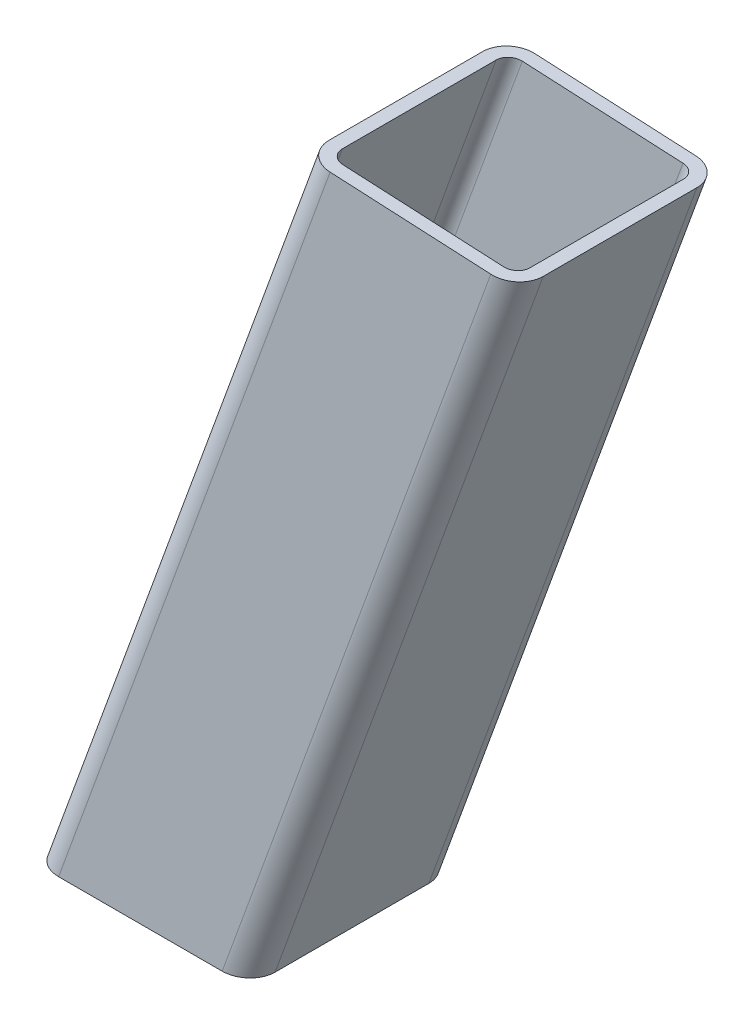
ISO-10303-21;
HEADER;
FILE_DESCRIPTION(('STEP AP214'),'2;1');
FILE_NAME('part.step','',(''),(''),'','','');
FILE_SCHEMA(('AUTOMOTIVE_DESIGN { 1 0 10303 214 1 1 1 1 }'));
ENDSEC;
DATA;
#1=APPLICATION_CONTEXT('core data for automotive mechanical design processes');
#2=APPLICATION_PROTOCOL_DEFINITION('international standard','automotive_design',2000,#1);
#3=PRODUCT_CONTEXT('',#1,'mechanical');
#4=PRODUCT('Part','Part','',(#3));
#5=PRODUCT_RELATED_PRODUCT_CATEGORY('part','',(#4));
#6=PRODUCT_DEFINITION_FORMATION('','',#4);
#7=PRODUCT_DEFINITION_CONTEXT('part definition',#1,'design');
#8=PRODUCT_DEFINITION('design','',#6,#7);
#9=PRODUCT_DEFINITION_SHAPE('','',#8);
#10=(LENGTH_UNIT() NAMED_UNIT(*) SI_UNIT(.MILLI.,.METRE.));
#11=(NAMED_UNIT(*) PLANE_ANGLE_UNIT() SI_UNIT($,.RADIAN.));
#12=(NAMED_UNIT(*) SI_UNIT($,.STERADIAN.) SOLID_ANGLE_UNIT());
#13=UNCERTAINTY_MEASURE_WITH_UNIT(LENGTH_MEASURE(1.E-05),#10,'distance_accuracy_value','');
#14=(GEOMETRIC_REPRESENTATION_CONTEXT(3) GLOBAL_UNCERTAINTY_ASSIGNED_CONTEXT((#13)) GLOBAL_UNIT_ASSIGNED_CONTEXT((#10,
#11,#12)) REPRESENTATION_CONTEXT('',''));
#15=CARTESIAN_POINT('',(0.,0.,0.));
#16=DIRECTION('',(0.,0.,1.));
#17=DIRECTION('',(1.,0.,0.));
#18=AXIS2_PLACEMENT_3D('',#15,#16,#17);
#19=CARTESIAN_POINT('',(356.44315661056,409.402345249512,30.));
#20=DIRECTION('',(0.939692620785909,-0.342020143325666,0.));
#21=DIRECTION('',(0.342020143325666,0.93969262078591,0.));
#22=AXIS2_PLACEMENT_3D('',#19,#20,#21);
#23=PLANE('',#22);
#24=DIRECTION('',(0.,0.,-1.));
#25=VECTOR('',#24,1.);
#26=CARTESIAN_POINT('',(228.179192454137,56.9999999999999,29.9999999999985));
#27=LINE('',#26,#25);
#28=CARTESIAN_POINT('',(228.179192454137,57.0000000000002,30.));
#29=VERTEX_POINT('',#28);
#30=CARTESIAN_POINT('',(228.179192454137,57.0000000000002,-30.));
#31=VERTEX_POINT('',#30);
#32=EDGE_CURVE('E184',#29,#31,#27,.T.);
#33=ORIENTED_EDGE('',*,*,#32,.F.);
#34=DIRECTION('',(-0.342020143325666,-0.939692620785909,0.));
#35=VECTOR('',#34,1.);
#36=CARTESIAN_POINT('',(356.44315661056,409.402345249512,30.));
#37=LINE('',#36,#35);
#38=CARTESIAN_POINT('',(334.330386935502,348.648009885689,30.));
#39=VERTEX_POINT('',#38);
#40=EDGE_CURVE('E217',#39,#29,#37,.T.);
#41=ORIENTED_EDGE('',*,*,#40,.F.);
#42=DIRECTION('',(0.,0.,1.));
#43=VECTOR('',#42,1.);
#44=CARTESIAN_POINT('',(334.330386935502,348.648009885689,30.));
#45=LINE('',#44,#43);
#46=CARTESIAN_POINT('',(334.330386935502,348.648009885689,-30.));
#47=VERTEX_POINT('',#46);
#48=EDGE_CURVE('E227',#47,#39,#45,.T.);
#49=ORIENTED_EDGE('',*,*,#48,.F.);
#50=DIRECTION('',(-0.342020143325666,-0.939692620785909,0.));
#51=VECTOR('',#50,1.);
#52=CARTESIAN_POINT('',(356.44315661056,409.402345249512,-30.));
#53=LINE('',#52,#51);
#54=EDGE_CURVE('E248',#47,#31,#53,.T.);
#55=ORIENTED_EDGE('',*,*,#54,.T.);
#56=EDGE_LOOP('',(#33,#41,#49,#55));
#57=FACE_BOUND('',#56,.T.);
#58=ADVANCED_FACE('F34',(#57),#23,.F.);
#59=CARTESIAN_POINT('',(365.840082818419,405.982143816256,-30.));
#60=DIRECTION('',(-0.342020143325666,-0.939692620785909,0.));
#61=DIRECTION('',(0.93969262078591,-0.342020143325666,0.));
#62=AXIS2_PLACEMENT_3D('',#59,#60,#61);
#63=CYLINDRICAL_SURFACE('',#62,10.);
#64=CARTESIAN_POINT('',(238.820970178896,57.0000000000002,-30.));
#65=DIRECTION('',(0.,-1.,0.));
#66=DIRECTION('',(-1.,0.,0.));
#67=AXIS2_PLACEMENT_3D('',#64,#65,#66);
#68=ELLIPSE('',#67,10.6417777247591,10.);
#69=CARTESIAN_POINT('',(238.820970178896,57.0000000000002,-40.));
#70=VERTEX_POINT('',#69);
#71=EDGE_CURVE('E183',#31,#70,#68,.T.);
#72=ORIENTED_EDGE('',*,*,#71,.F.);
#73=ORIENTED_EDGE('',*,*,#54,.F.);
#74=CARTESIAN_POINT('',(344.781706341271,348.124729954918,-30.));
#75=DIRECTION('',(0.0500056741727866,0.998748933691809,0.));
#76=DIRECTION('',(-0.998748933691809,0.0500056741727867,0.));
#77=AXIS2_PLACEMENT_3D('',#74,#75,#76);
#78=ELLIPSE('',#77,10.464411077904,10.);
#79=CARTESIAN_POINT('',(344.781706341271,348.124729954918,-40.));
#80=VERTEX_POINT('',#79);
#81=EDGE_CURVE('E122',#80,#47,#78,.T.);
#82=ORIENTED_EDGE('',*,*,#81,.F.);
#83=DIRECTION('',(-0.342020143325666,-0.939692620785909,0.));
#84=VECTOR('',#83,1.);
#85=CARTESIAN_POINT('',(365.840082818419,405.982143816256,-40.));
#86=LINE('',#85,#84);
#87=EDGE_CURVE('E245',#80,#70,#86,.T.);
#88=ORIENTED_EDGE('',*,*,#87,.T.);
#89=EDGE_LOOP('',(#72,#73,#82,#88));
#90=FACE_BOUND('',#89,.T.);
#91=ADVANCED_FACE('F308',(#90),#63,.T.);
#92=CARTESIAN_POINT('',(422.221640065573,385.460935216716,-40.));
#93=DIRECTION('',(0.,0.,1.));
#94=DIRECTION('',(1.,0.,0.));
#95=AXIS2_PLACEMENT_3D('',#92,#93,#94);
#96=PLANE('',#95);
#97=DIRECTION('',(1.,0.,0.));
#98=VECTOR('',#97,1.);
#99=CARTESIAN_POINT('',(422.221640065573,57.0000000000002,-40.));
#100=LINE('',#99,#98);
#101=CARTESIAN_POINT('',(302.671636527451,57.0000000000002,-40.));
#102=VERTEX_POINT('',#101);
#103=EDGE_CURVE('E181',#70,#102,#100,.T.);
#104=ORIENTED_EDGE('',*,*,#103,.F.);
#105=ORIENTED_EDGE('',*,*,#87,.F.);
#106=DIRECTION('',(-0.998748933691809,0.0500056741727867,0.));
#107=VECTOR('',#106,1.);
#108=CARTESIAN_POINT('',(420.163309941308,344.35050023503,-40.));
#109=LINE('',#108,#107);
#110=CARTESIAN_POINT('',(407.489622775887,344.985050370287,-40.));
#111=VERTEX_POINT('',#110);
#112=EDGE_CURVE('E118',#111,#80,#109,.T.);
#113=ORIENTED_EDGE('',*,*,#112,.F.);
#114=DIRECTION('',(-0.342020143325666,-0.939692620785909,0.));
#115=VECTOR('',#114,1.);
#116=CARTESIAN_POINT('',(422.221640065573,385.460935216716,-40.));
#117=LINE('',#116,#115);
#118=EDGE_CURVE('E242',#111,#102,#117,.T.);
#119=ORIENTED_EDGE('',*,*,#118,.T.);
#120=EDGE_LOOP('',(#104,#105,#113,#119));
#121=FACE_BOUND('',#120,.T.);
#122=ADVANCED_FACE('F306',(#121),#96,.F.);
#123=CARTESIAN_POINT('',(422.221640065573,385.460935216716,-30.));
#124=DIRECTION('',(-0.342020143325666,-0.939692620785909,0.));
#125=DIRECTION('',(0.93969262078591,-0.342020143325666,0.));
#126=AXIS2_PLACEMENT_3D('',#123,#124,#125);
#127=CYLINDRICAL_SURFACE('',#126,10.);
#128=CARTESIAN_POINT('',(302.671636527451,57.0000000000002,-30.));
#129=DIRECTION('',(0.,-1.,0.));
#130=DIRECTION('',(-1.,0.,0.));
#131=AXIS2_PLACEMENT_3D('',#128,#129,#130);
#132=ELLIPSE('',#131,10.6417777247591,10.);
#133=CARTESIAN_POINT('',(313.31341425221,57.0000000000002,-30.));
#134=VERTEX_POINT('',#133);
#135=EDGE_CURVE('E179',#102,#134,#132,.T.);
#136=ORIENTED_EDGE('',*,*,#135,.F.);
#137=ORIENTED_EDGE('',*,*,#118,.F.);
#138=CARTESIAN_POINT('',(407.489622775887,344.985050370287,-30.));
#139=DIRECTION('',(0.0500056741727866,0.998748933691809,0.));
#140=DIRECTION('',(-0.998748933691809,0.0500056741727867,0.));
#141=AXIS2_PLACEMENT_3D('',#138,#139,#140);
#142=ELLIPSE('',#141,10.4644110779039,10.);
#143=CARTESIAN_POINT('',(417.940942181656,344.461770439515,-30.));
#144=VERTEX_POINT('',#143);
#145=EDGE_CURVE('E223',#144,#111,#142,.T.);
#146=ORIENTED_EDGE('',*,*,#145,.F.);
#147=DIRECTION('',(-0.342020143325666,-0.939692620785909,0.));
#148=VECTOR('',#147,1.);
#149=CARTESIAN_POINT('',(431.618566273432,382.040733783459,-30.));
#150=LINE('',#149,#148);
#151=EDGE_CURVE('E239',#144,#134,#150,.T.);
#152=ORIENTED_EDGE('',*,*,#151,.T.);
#153=EDGE_LOOP('',(#136,#137,#146,#152));
#154=FACE_BOUND('',#153,.T.);
#155=ADVANCED_FACE('F301',(#154),#127,.T.);
#156=CARTESIAN_POINT('',(431.618566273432,382.040733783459,-30.));
#157=DIRECTION('',(-0.939692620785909,0.342020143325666,0.));
#158=DIRECTION('',(-0.342020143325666,-0.93969262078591,0.));
#159=AXIS2_PLACEMENT_3D('',#156,#157,#158);
#160=PLANE('',#159);
#161=DIRECTION('',(0.,0.,1.));
#162=VECTOR('',#161,1.);
#163=CARTESIAN_POINT('',(313.31341425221,57.0000000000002,-30.0000000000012));
#164=LINE('',#163,#162);
#165=CARTESIAN_POINT('',(313.31341425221,56.9999999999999,30.));
#166=VERTEX_POINT('',#165);
#167=EDGE_CURVE('E173',#134,#166,#164,.T.);
#168=ORIENTED_EDGE('',*,*,#167,.F.);
#169=ORIENTED_EDGE('',*,*,#151,.F.);
#170=DIRECTION('',(0.,0.,-1.));
#171=VECTOR('',#170,1.);
#172=CARTESIAN_POINT('',(417.940942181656,344.461770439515,-30.));
#173=LINE('',#172,#171);
#174=CARTESIAN_POINT('',(417.940942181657,344.461770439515,30.));
#175=VERTEX_POINT('',#174);
#176=EDGE_CURVE('E221',#175,#144,#173,.T.);
#177=ORIENTED_EDGE('',*,*,#176,.F.);
#178=DIRECTION('',(-0.342020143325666,-0.939692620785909,0.));
#179=VECTOR('',#178,1.);
#180=CARTESIAN_POINT('',(431.618566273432,382.040733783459,30.));
#181=LINE('',#180,#179);
#182=EDGE_CURVE('E236',#175,#166,#181,.T.);
#183=ORIENTED_EDGE('',*,*,#182,.T.);
#184=EDGE_LOOP('',(#168,#169,#177,#183));
#185=FACE_BOUND('',#184,.T.);
#186=ADVANCED_FACE('F298',(#185),#160,.F.);
#187=CARTESIAN_POINT('',(422.221640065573,385.460935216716,30.));
#188=DIRECTION('',(-0.342020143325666,-0.939692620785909,0.));
#189=DIRECTION('',(0.93969262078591,-0.342020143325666,0.));
#190=AXIS2_PLACEMENT_3D('',#187,#188,#189);
#191=CYLINDRICAL_SURFACE('',#190,10.);
#192=CARTESIAN_POINT('',(302.671636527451,56.9999999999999,30.));
#193=DIRECTION('',(0.,-1.,0.));
#194=DIRECTION('',(-1.,0.,0.));
#195=AXIS2_PLACEMENT_3D('',#192,#193,#194);
#196=ELLIPSE('',#195,10.6417777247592,10.);
#197=CARTESIAN_POINT('',(302.671636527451,56.9999999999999,40.));
#198=VERTEX_POINT('',#197);
#199=EDGE_CURVE('E171',#166,#198,#196,.T.);
#200=ORIENTED_EDGE('',*,*,#199,.F.);
#201=ORIENTED_EDGE('',*,*,#182,.F.);
#202=CARTESIAN_POINT('',(407.489622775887,344.985050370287,30.));
#203=DIRECTION('',(0.0500056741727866,0.998748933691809,0.));
#204=DIRECTION('',(-0.998748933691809,0.0500056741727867,0.));
#205=AXIS2_PLACEMENT_3D('',#202,#203,#204);
#206=ELLIPSE('',#205,10.464411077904,10.);
#207=CARTESIAN_POINT('',(407.489622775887,344.985050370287,40.));
#208=VERTEX_POINT('',#207);
#209=EDGE_CURVE('E219',#208,#175,#206,.T.);
#210=ORIENTED_EDGE('',*,*,#209,.F.);
#211=DIRECTION('',(-0.342020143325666,-0.939692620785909,0.));
#212=VECTOR('',#211,1.);
#213=CARTESIAN_POINT('',(422.221640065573,385.460935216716,40.));
#214=LINE('',#213,#212);
#215=EDGE_CURVE('E233',#208,#198,#214,.T.);
#216=ORIENTED_EDGE('',*,*,#215,.T.);
#217=EDGE_LOOP('',(#200,#201,#210,#216));
#218=FACE_BOUND('',#217,.T.);
#219=ADVANCED_FACE('F291',(#218),#191,.T.);
#220=CARTESIAN_POINT('',(365.840082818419,405.982143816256,40.));
#221=DIRECTION('',(0.,0.,-1.));
#222=DIRECTION('',(-1.,0.,0.));
#223=AXIS2_PLACEMENT_3D('',#220,#221,#222);
#224=PLANE('',#223);
#225=DIRECTION('',(-1.,0.,0.));
#226=VECTOR('',#225,1.);
#227=CARTESIAN_POINT('',(365.840082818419,56.9999999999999,40.));
#228=LINE('',#227,#226);
#229=CARTESIAN_POINT('',(238.820970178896,56.9999999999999,40.));
#230=VERTEX_POINT('',#229);
#231=EDGE_CURVE('E53',#198,#230,#228,.T.);
#232=ORIENTED_EDGE('',*,*,#231,.F.);
#233=ORIENTED_EDGE('',*,*,#215,.F.);
#234=DIRECTION('',(0.998748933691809,-0.0500056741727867,0.));
#235=VECTOR('',#234,1.);
#236=CARTESIAN_POINT('',(362.897845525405,347.21768542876,40.));
#237=LINE('',#236,#235);
#238=CARTESIAN_POINT('',(344.781706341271,348.124729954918,40.));
#239=VERTEX_POINT('',#238);
#240=EDGE_CURVE('E216',#239,#208,#237,.T.);
#241=ORIENTED_EDGE('',*,*,#240,.F.);
#242=DIRECTION('',(-0.342020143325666,-0.939692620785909,0.));
#243=VECTOR('',#242,1.);
#244=CARTESIAN_POINT('',(365.840082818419,405.982143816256,40.));
#245=LINE('',#244,#243);
#246=EDGE_CURVE('E230',#239,#230,#245,.T.);
#247=ORIENTED_EDGE('',*,*,#246,.T.);
#248=EDGE_LOOP('',(#232,#233,#241,#247));
#249=FACE_BOUND('',#248,.T.);
#250=ADVANCED_FACE('F288',(#249),#224,.F.);
#251=CARTESIAN_POINT('',(365.840082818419,405.982143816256,30.));
#252=DIRECTION('',(-0.342020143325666,-0.939692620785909,0.));
#253=DIRECTION('',(0.93969262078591,-0.342020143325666,0.));
#254=AXIS2_PLACEMENT_3D('',#251,#252,#253);
#255=CYLINDRICAL_SURFACE('',#254,10.);
#256=CARTESIAN_POINT('',(238.820970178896,56.9999999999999,30.));
#257=DIRECTION('',(0.,-1.,0.));
#258=DIRECTION('',(-1.,0.,0.));
#259=AXIS2_PLACEMENT_3D('',#256,#257,#258);
#260=ELLIPSE('',#259,10.6417777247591,10.);
#261=EDGE_CURVE('E176',#230,#29,#260,.T.);
#262=ORIENTED_EDGE('',*,*,#261,.F.);
#263=ORIENTED_EDGE('',*,*,#246,.F.);
#264=CARTESIAN_POINT('',(344.781706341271,348.124729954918,30.));
#265=DIRECTION('',(0.0500056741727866,0.998748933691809,0.));
#266=DIRECTION('',(-0.998748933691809,0.0500056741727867,0.));
#267=AXIS2_PLACEMENT_3D('',#264,#265,#266);
#268=ELLIPSE('',#267,10.464411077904,10.);
#269=EDGE_CURVE('E214',#39,#239,#268,.T.);
#270=ORIENTED_EDGE('',*,*,#269,.F.);
#271=ORIENTED_EDGE('',*,*,#40,.T.);
#272=EDGE_LOOP('',(#262,#263,#270,#271));
#273=FACE_BOUND('',#272,.T.);
#274=ADVANCED_FACE('F36',(#273),#255,.T.);
#275=CARTESIAN_POINT('',(6158.08276398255,57.0625533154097,-40.));
#276=DIRECTION('',(0.0500056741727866,0.998748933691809,0.));
#277=DIRECTION('',(-0.998748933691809,0.0500056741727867,0.));
#278=AXIS2_PLACEMENT_3D('',#275,#276,#277);
#279=PLANE('',#278);
#280=DIRECTION('',(0.998748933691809,-0.0500056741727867,0.));
#281=VECTOR('',#280,1.);
#282=CARTESIAN_POINT('',(362.897845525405,347.21768542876,35.));
#283=LINE('',#282,#281);
#284=CARTESIAN_POINT('',(344.781706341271,348.124729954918,35.));
#285=VERTEX_POINT('',#284);
#286=CARTESIAN_POINT('',(407.489622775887,344.985050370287,35.));
#287=VERTEX_POINT('',#286);
#288=EDGE_CURVE('E186',#285,#287,#283,.T.);
#289=ORIENTED_EDGE('',*,*,#288,.F.);
#290=CARTESIAN_POINT('',(344.781706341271,348.124729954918,30.));
#291=DIRECTION('',(0.0500056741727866,0.998748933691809,0.));
#292=DIRECTION('',(-0.998748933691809,0.0500056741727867,0.));
#293=AXIS2_PLACEMENT_3D('',#290,#291,#292);
#294=ELLIPSE('',#293,5.23220553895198,5.00000000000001);
#295=CARTESIAN_POINT('',(339.556046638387,348.386369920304,30.));
#296=VERTEX_POINT('',#295);
#297=EDGE_CURVE('E191',#296,#285,#294,.T.);
#298=ORIENTED_EDGE('',*,*,#297,.F.);
#299=DIRECTION('',(0.,0.,1.));
#300=VECTOR('',#299,1.);
#301=CARTESIAN_POINT('',(339.556046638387,348.386369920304,30.));
#302=LINE('',#301,#300);
#303=CARTESIAN_POINT('',(339.556046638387,348.386369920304,-30.));
#304=VERTEX_POINT('',#303);
#305=EDGE_CURVE('E196',#304,#296,#302,.T.);
#306=ORIENTED_EDGE('',*,*,#305,.F.);
#307=CARTESIAN_POINT('',(344.781706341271,348.124729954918,-30.));
#308=DIRECTION('',(0.0500056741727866,0.998748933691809,0.));
#309=DIRECTION('',(-0.998748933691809,0.0500056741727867,0.));
#310=AXIS2_PLACEMENT_3D('',#307,#308,#309);
#311=ELLIPSE('',#310,5.23220553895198,5.00000000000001);
#312=CARTESIAN_POINT('',(344.781706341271,348.124729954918,-35.));
#313=VERTEX_POINT('',#312);
#314=EDGE_CURVE('E201',#313,#304,#311,.T.);
#315=ORIENTED_EDGE('',*,*,#314,.F.);
#316=DIRECTION('',(-0.998748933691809,0.0500056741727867,0.));
#317=VECTOR('',#316,1.);
#318=CARTESIAN_POINT('',(420.163309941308,344.35050023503,-35.));
#319=LINE('',#318,#317);
#320=CARTESIAN_POINT('',(407.489622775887,344.985050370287,-35.));
#321=VERTEX_POINT('',#320);
#322=EDGE_CURVE('E206',#321,#313,#319,.T.);
#323=ORIENTED_EDGE('',*,*,#322,.F.);
#324=CARTESIAN_POINT('',(407.489622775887,344.985050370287,-30.));
#325=DIRECTION('',(0.0500056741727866,0.998748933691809,0.));
#326=DIRECTION('',(-0.998748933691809,0.0500056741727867,0.));
#327=AXIS2_PLACEMENT_3D('',#324,#325,#326);
#328=ELLIPSE('',#327,5.23220553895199,5.00000000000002);
#329=CARTESIAN_POINT('',(412.715282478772,344.723410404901,-30.));
#330=VERTEX_POINT('',#329);
#331=EDGE_CURVE('E167',#330,#321,#328,.T.);
#332=ORIENTED_EDGE('',*,*,#331,.F.);
#333=DIRECTION('',(0.,0.,-1.));
#334=VECTOR('',#333,1.);
#335=CARTESIAN_POINT('',(412.715282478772,344.723410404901,-30.));
#336=LINE('',#335,#334);
#337=CARTESIAN_POINT('',(412.715282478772,344.723410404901,30.));
#338=VERTEX_POINT('',#337);
#339=EDGE_CURVE('E158',#338,#330,#336,.T.);
#340=ORIENTED_EDGE('',*,*,#339,.F.);
#341=CARTESIAN_POINT('',(407.489622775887,344.985050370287,30.));
#342=DIRECTION('',(0.0500056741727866,0.998748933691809,0.));
#343=DIRECTION('',(-0.998748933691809,0.0500056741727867,0.));
#344=AXIS2_PLACEMENT_3D('',#341,#342,#343);
#345=ELLIPSE('',#344,5.23220553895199,5.00000000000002);
#346=EDGE_CURVE('E11',#287,#338,#345,.T.);
#347=ORIENTED_EDGE('',*,*,#346,.F.);
#348=EDGE_LOOP('',(#289,#298,#306,#315,#323,#332,#340,#347));
#349=FACE_BOUND('',#348,.T.);
#350=ORIENTED_EDGE('',*,*,#269,.T.);
#351=ORIENTED_EDGE('',*,*,#240,.T.);
#352=ORIENTED_EDGE('',*,*,#209,.T.);
#353=ORIENTED_EDGE('',*,*,#176,.T.);
#354=ORIENTED_EDGE('',*,*,#145,.T.);
#355=ORIENTED_EDGE('',*,*,#112,.T.);
#356=ORIENTED_EDGE('',*,*,#81,.T.);
#357=ORIENTED_EDGE('',*,*,#48,.T.);
#358=EDGE_LOOP('',(#350,#351,#352,#353,#354,#355,#356,#357));
#359=FACE_BOUND('',#358,.T.);
#360=ADVANCED_FACE('F284',(#349,#359),#279,.T.);
#361=CARTESIAN_POINT('',(9149.96897120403,57.0000000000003,-59.9999999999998));
#362=DIRECTION('',(0.,-1.,0.));
#363=DIRECTION('',(0.,0.,-1.));
#364=AXIS2_PLACEMENT_3D('',#361,#362,#363);
#365=PLANE('',#364);
#366=DIRECTION('',(0.,0.,1.));
#367=VECTOR('',#366,1.);
#368=CARTESIAN_POINT('',(307.99252538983,57.0000000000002,-30.0000000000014));
#369=LINE('',#368,#367);
#370=CARTESIAN_POINT('',(307.99252538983,57.0000000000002,-30.));
#371=VERTEX_POINT('',#370);
#372=CARTESIAN_POINT('',(307.99252538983,57.0000000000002,30.));
#373=VERTEX_POINT('',#372);
#374=EDGE_CURVE('E151',#371,#373,#369,.T.);
#375=ORIENTED_EDGE('',*,*,#374,.F.);
#376=CARTESIAN_POINT('',(302.671636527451,57.0000000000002,-30.));
#377=DIRECTION('',(0.,-1.,0.));
#378=DIRECTION('',(-1.,0.,0.));
#379=AXIS2_PLACEMENT_3D('',#376,#377,#378);
#380=ELLIPSE('',#379,5.32088886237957,5.00000000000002);
#381=CARTESIAN_POINT('',(302.671636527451,57.0000000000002,-35.));
#382=VERTEX_POINT('',#381);
#383=EDGE_CURVE('E147',#382,#371,#380,.T.);
#384=ORIENTED_EDGE('',*,*,#383,.F.);
#385=DIRECTION('',(1.,0.,0.));
#386=VECTOR('',#385,1.);
#387=CARTESIAN_POINT('',(422.221640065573,57.0000000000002,-35.));
#388=LINE('',#387,#386);
#389=CARTESIAN_POINT('',(238.820970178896,57.0000000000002,-35.));
#390=VERTEX_POINT('',#389);
#391=EDGE_CURVE('E210',#390,#382,#388,.T.);
#392=ORIENTED_EDGE('',*,*,#391,.F.);
#393=CARTESIAN_POINT('',(238.820970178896,57.0000000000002,-30.));
#394=DIRECTION('',(0.,-1.,0.));
#395=DIRECTION('',(-1.,0.,0.));
#396=AXIS2_PLACEMENT_3D('',#393,#394,#395);
#397=ELLIPSE('',#396,5.32088886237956,5.00000000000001);
#398=CARTESIAN_POINT('',(233.500081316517,57.0000000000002,-30.));
#399=VERTEX_POINT('',#398);
#400=EDGE_CURVE('E205',#399,#390,#397,.T.);
#401=ORIENTED_EDGE('',*,*,#400,.F.);
#402=DIRECTION('',(0.,0.,-1.));
#403=VECTOR('',#402,1.);
#404=CARTESIAN_POINT('',(233.500081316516,56.9999999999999,29.9999999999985));
#405=LINE('',#404,#403);
#406=CARTESIAN_POINT('',(233.500081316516,56.9999999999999,30.));
#407=VERTEX_POINT('',#406);
#408=EDGE_CURVE('E200',#407,#399,#405,.T.);
#409=ORIENTED_EDGE('',*,*,#408,.F.);
#410=CARTESIAN_POINT('',(238.820970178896,56.9999999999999,30.));
#411=DIRECTION('',(0.,-1.,0.));
#412=DIRECTION('',(-1.,0.,0.));
#413=AXIS2_PLACEMENT_3D('',#410,#411,#412);
#414=ELLIPSE('',#413,5.32088886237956,5.00000000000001);
#415=CARTESIAN_POINT('',(238.820970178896,56.9999999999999,35.));
#416=VERTEX_POINT('',#415);
#417=EDGE_CURVE('E195',#416,#407,#414,.T.);
#418=ORIENTED_EDGE('',*,*,#417,.F.);
#419=DIRECTION('',(-1.,0.,0.));
#420=VECTOR('',#419,1.);
#421=CARTESIAN_POINT('',(365.840082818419,56.9999999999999,35.));
#422=LINE('',#421,#420);
#423=CARTESIAN_POINT('',(302.671636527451,57.,35.));
#424=VERTEX_POINT('',#423);
#425=EDGE_CURVE('E190',#424,#416,#422,.T.);
#426=ORIENTED_EDGE('',*,*,#425,.F.);
#427=CARTESIAN_POINT('',(302.671636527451,56.9999999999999,30.));
#428=DIRECTION('',(0.,-1.,0.));
#429=DIRECTION('',(-1.,0.,0.));
#430=AXIS2_PLACEMENT_3D('',#427,#428,#429);
#431=ELLIPSE('',#430,5.32088886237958,5.00000000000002);
#432=EDGE_CURVE('E44',#373,#424,#431,.T.);
#433=ORIENTED_EDGE('',*,*,#432,.F.);
#434=EDGE_LOOP('',(#375,#384,#392,#401,#409,#418,#426,#433));
#435=FACE_BOUND('',#434,.T.);
#436=ORIENTED_EDGE('',*,*,#261,.T.);
#437=ORIENTED_EDGE('',*,*,#32,.T.);
#438=ORIENTED_EDGE('',*,*,#71,.T.);
#439=ORIENTED_EDGE('',*,*,#103,.T.);
#440=ORIENTED_EDGE('',*,*,#135,.T.);
#441=ORIENTED_EDGE('',*,*,#167,.T.);
#442=ORIENTED_EDGE('',*,*,#199,.T.);
#443=ORIENTED_EDGE('',*,*,#231,.T.);
#444=EDGE_LOOP('',(#436,#437,#438,#439,#440,#441,#442,#443));
#445=FACE_BOUND('',#444,.T.);
#446=ADVANCED_FACE('F152',(#435,#445),#365,.T.);
#447=CARTESIAN_POINT('',(426.920103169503,383.750834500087,-30.));
#448=DIRECTION('',(-0.939692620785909,0.342020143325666,0.));
#449=DIRECTION('',(-0.342020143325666,-0.93969262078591,0.));
#450=AXIS2_PLACEMENT_3D('',#447,#448,#449);
#451=PLANE('',#450);
#452=DIRECTION('',(-0.342020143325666,-0.939692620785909,0.));
#453=VECTOR('',#452,1.);
#454=CARTESIAN_POINT('',(426.920103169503,383.750834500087,-30.));
#455=LINE('',#454,#453);
#456=EDGE_CURVE('E38',#330,#371,#455,.T.);
#457=ORIENTED_EDGE('',*,*,#456,.T.);
#458=ORIENTED_EDGE('',*,*,#374,.T.);
#459=DIRECTION('',(-0.342020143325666,-0.939692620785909,0.));
#460=VECTOR('',#459,1.);
#461=CARTESIAN_POINT('',(426.920103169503,383.750834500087,30.));
#462=LINE('',#461,#460);
#463=EDGE_CURVE('E189',#338,#373,#462,.T.);
#464=ORIENTED_EDGE('',*,*,#463,.F.);
#465=ORIENTED_EDGE('',*,*,#339,.T.);
#466=EDGE_LOOP('',(#457,#458,#464,#465));
#467=FACE_BOUND('',#466,.T.);
#468=ADVANCED_FACE('F170',(#467),#451,.T.);
#469=CARTESIAN_POINT('',(422.221640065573,385.460935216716,-30.));
#470=DIRECTION('',(-0.342020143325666,-0.939692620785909,0.));
#471=DIRECTION('',(0.93969262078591,-0.342020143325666,0.));
#472=AXIS2_PLACEMENT_3D('',#469,#470,#471);
#473=CYLINDRICAL_SURFACE('',#472,5.00000000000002);
#474=DIRECTION('',(-0.342020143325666,-0.939692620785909,0.));
#475=VECTOR('',#474,1.);
#476=CARTESIAN_POINT('',(422.221640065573,385.460935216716,-35.));
#477=LINE('',#476,#475);
#478=EDGE_CURVE('E166',#321,#382,#477,.T.);
#479=ORIENTED_EDGE('',*,*,#478,.T.);
#480=ORIENTED_EDGE('',*,*,#383,.T.);
#481=ORIENTED_EDGE('',*,*,#456,.F.);
#482=ORIENTED_EDGE('',*,*,#331,.T.);
#483=EDGE_LOOP('',(#479,#480,#481,#482));
#484=FACE_BOUND('',#483,.T.);
#485=ADVANCED_FACE('F163',(#484),#473,.F.);
#486=CARTESIAN_POINT('',(422.221640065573,385.460935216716,-35.));
#487=DIRECTION('',(0.,0.,1.));
#488=DIRECTION('',(1.,0.,0.));
#489=AXIS2_PLACEMENT_3D('',#486,#487,#488);
#490=PLANE('',#489);
#491=DIRECTION('',(-0.342020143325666,-0.939692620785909,0.));
#492=VECTOR('',#491,1.);
#493=CARTESIAN_POINT('',(365.840082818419,405.982143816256,-35.));
#494=LINE('',#493,#492);
#495=EDGE_CURVE('E212',#313,#390,#494,.T.);
#496=ORIENTED_EDGE('',*,*,#495,.T.);
#497=ORIENTED_EDGE('',*,*,#391,.T.);
#498=ORIENTED_EDGE('',*,*,#478,.F.);
#499=ORIENTED_EDGE('',*,*,#322,.T.);
#500=EDGE_LOOP('',(#496,#497,#498,#499));
#501=FACE_BOUND('',#500,.T.);
#502=ADVANCED_FACE('F342',(#501),#490,.T.);
#503=CARTESIAN_POINT('',(365.840082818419,405.982143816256,-30.));
#504=DIRECTION('',(-0.342020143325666,-0.939692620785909,0.));
#505=DIRECTION('',(0.93969262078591,-0.342020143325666,0.));
#506=AXIS2_PLACEMENT_3D('',#503,#504,#505);
#507=CYLINDRICAL_SURFACE('',#506,5.00000000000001);
#508=DIRECTION('',(-0.342020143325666,-0.939692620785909,0.));
#509=VECTOR('',#508,1.);
#510=CARTESIAN_POINT('',(361.141619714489,407.692244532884,-30.));
#511=LINE('',#510,#509);
#512=EDGE_CURVE('E209',#304,#399,#511,.T.);
#513=ORIENTED_EDGE('',*,*,#512,.T.);
#514=ORIENTED_EDGE('',*,*,#400,.T.);
#515=ORIENTED_EDGE('',*,*,#495,.F.);
#516=ORIENTED_EDGE('',*,*,#314,.T.);
#517=EDGE_LOOP('',(#513,#514,#515,#516));
#518=FACE_BOUND('',#517,.T.);
#519=ADVANCED_FACE('F345',(#518),#507,.F.);
#520=CARTESIAN_POINT('',(361.141619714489,407.692244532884,30.));
#521=DIRECTION('',(0.939692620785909,-0.342020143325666,0.));
#522=DIRECTION('',(0.342020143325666,0.93969262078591,0.));
#523=AXIS2_PLACEMENT_3D('',#520,#521,#522);
#524=PLANE('',#523);
#525=DIRECTION('',(-0.342020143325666,-0.939692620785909,0.));
#526=VECTOR('',#525,1.);
#527=CARTESIAN_POINT('',(361.141619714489,407.692244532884,30.));
#528=LINE('',#527,#526);
#529=EDGE_CURVE('E204',#296,#407,#528,.T.);
#530=ORIENTED_EDGE('',*,*,#529,.T.);
#531=ORIENTED_EDGE('',*,*,#408,.T.);
#532=ORIENTED_EDGE('',*,*,#512,.F.);
#533=ORIENTED_EDGE('',*,*,#305,.T.);
#534=EDGE_LOOP('',(#530,#531,#532,#533));
#535=FACE_BOUND('',#534,.T.);
#536=ADVANCED_FACE('F348',(#535),#524,.T.);
#537=CARTESIAN_POINT('',(365.840082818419,405.982143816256,30.));
#538=DIRECTION('',(-0.342020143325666,-0.939692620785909,0.));
#539=DIRECTION('',(0.93969262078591,-0.342020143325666,0.));
#540=AXIS2_PLACEMENT_3D('',#537,#538,#539);
#541=CYLINDRICAL_SURFACE('',#540,5.00000000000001);
#542=DIRECTION('',(-0.342020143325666,-0.939692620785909,0.));
#543=VECTOR('',#542,1.);
#544=CARTESIAN_POINT('',(365.840082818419,405.982143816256,35.));
#545=LINE('',#544,#543);
#546=EDGE_CURVE('E199',#285,#416,#545,.T.);
#547=ORIENTED_EDGE('',*,*,#546,.T.);
#548=ORIENTED_EDGE('',*,*,#417,.T.);
#549=ORIENTED_EDGE('',*,*,#529,.F.);
#550=ORIENTED_EDGE('',*,*,#297,.T.);
#551=EDGE_LOOP('',(#547,#548,#549,#550));
#552=FACE_BOUND('',#551,.T.);
#553=ADVANCED_FACE('F352',(#552),#541,.F.);
#554=CARTESIAN_POINT('',(365.840082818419,405.982143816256,35.));
#555=DIRECTION('',(0.,0.,-1.));
#556=DIRECTION('',(-1.,0.,0.));
#557=AXIS2_PLACEMENT_3D('',#554,#555,#556);
#558=PLANE('',#557);
#559=DIRECTION('',(-0.342020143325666,-0.939692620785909,0.));
#560=VECTOR('',#559,1.);
#561=CARTESIAN_POINT('',(422.221640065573,385.460935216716,35.));
#562=LINE('',#561,#560);
#563=EDGE_CURVE('E194',#287,#424,#562,.T.);
#564=ORIENTED_EDGE('',*,*,#563,.T.);
#565=ORIENTED_EDGE('',*,*,#425,.T.);
#566=ORIENTED_EDGE('',*,*,#546,.F.);
#567=ORIENTED_EDGE('',*,*,#288,.T.);
#568=EDGE_LOOP('',(#564,#565,#566,#567));
#569=FACE_BOUND('',#568,.T.);
#570=ADVANCED_FACE('F356',(#569),#558,.T.);
#571=CARTESIAN_POINT('',(422.221640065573,385.460935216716,30.));
#572=DIRECTION('',(-0.342020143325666,-0.939692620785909,0.));
#573=DIRECTION('',(0.93969262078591,-0.342020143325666,0.));
#574=AXIS2_PLACEMENT_3D('',#571,#572,#573);
#575=CYLINDRICAL_SURFACE('',#574,5.00000000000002);
#576=ORIENTED_EDGE('',*,*,#463,.T.);
#577=ORIENTED_EDGE('',*,*,#432,.T.);
#578=ORIENTED_EDGE('',*,*,#563,.F.);
#579=ORIENTED_EDGE('',*,*,#346,.T.);
#580=EDGE_LOOP('',(#576,#577,#578,#579));
#581=FACE_BOUND('',#580,.T.);
#582=ADVANCED_FACE('F359',(#581),#575,.F.);
#583=CLOSED_SHELL('',(#58,#91,#122,#155,#186,#219,#250,#274,#360,#446,#468,#485,#502,#519,#536,
#553,#570,#582));
#584=MANIFOLD_SOLID_BREP('B2',#583);
#585=ADVANCED_BREP_SHAPE_REPRESENTATION('',(#18,#584),#14);
#586=SHAPE_DEFINITION_REPRESENTATION(#9,#585);
ENDSEC;
END-ISO-10303-21;
